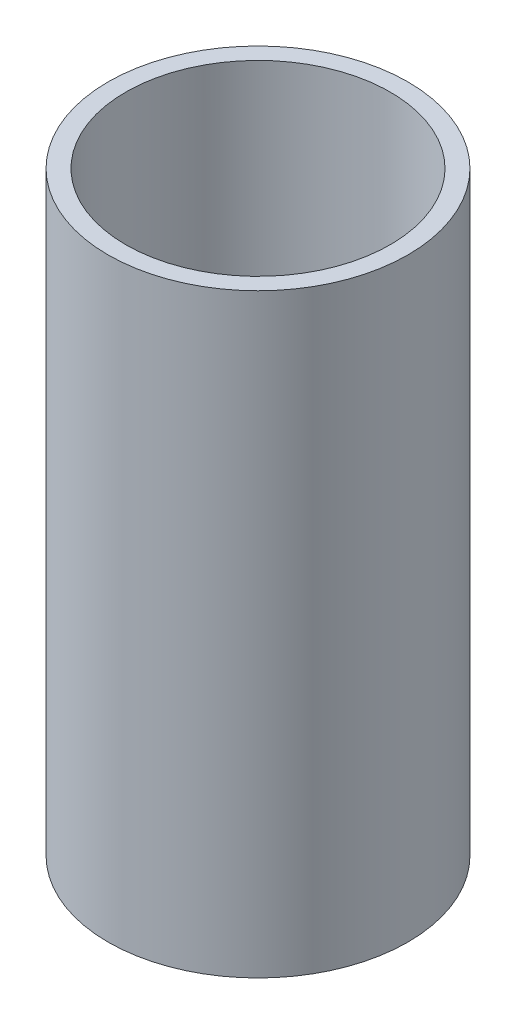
from build123d import *

# Parameters (mm, degrees)
SKETCH1_R           = 43.18
BOSS_EXTRUDE1_DEPTH = 171.45
SKETCH2_R           = 38.1
CUT_EXTRUDE1_DEPTH  = 183.000349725
SKETCH3_W           = 12.7
SKETCH3_H           = 6.35
BOSS_EXTRUDE2_DEPTH = 2.54


with BuildPart() as part:
    # Sketch1 → Boss-Extrude1 (new body)
    with BuildSketch(Plane(origin=(0, 0, 0), x_dir=(1, 0, 0), z_dir=(0, 1, 0))):
        with Locations(Location((0, 0, 0), (0, 0, 270))):
            Circle(SKETCH1_R)
    extrude(amount=BOSS_EXTRUDE1_DEPTH)

    # Sketch2 → Cut-Extrude1 (cut, through all)
    with BuildSketch(Plane(origin=(0, 171.45, 0), x_dir=(1, 0, 0), z_dir=(0, 1, 0))):
        with Locations(Location((0, 0, 0), (0, 0, 270))):
            Circle(SKETCH2_R)
    extrude(amount=-CUT_EXTRUDE1_DEPTH, mode=Mode.SUBTRACT)

    # Sketch3 → Boss-Extrude2 (add)
    with BuildSketch(Plane.ZY.offset(-38.1)):
        with Locations((0, 3.175)):
            Rectangle(SKETCH3_W, SKETCH3_H)
    extrude(amount=BOSS_EXTRUDE2_DEPTH)


solid = part.part
